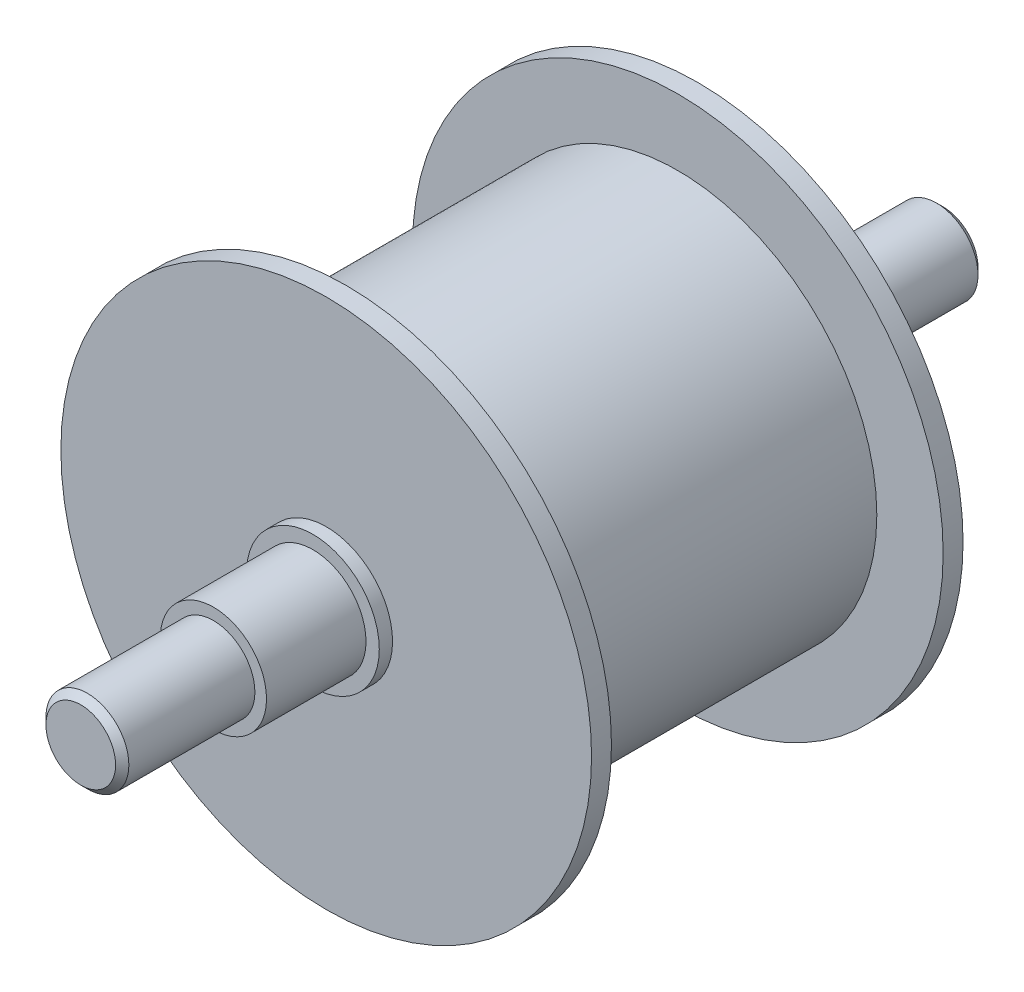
ISO-10303-21;
HEADER;
FILE_DESCRIPTION(('STEP AP214'),'2;1');
FILE_NAME('part.step','',(''),(''),'','','');
FILE_SCHEMA(('AUTOMOTIVE_DESIGN { 1 0 10303 214 1 1 1 1 }'));
ENDSEC;
DATA;
#1=APPLICATION_CONTEXT('core data for automotive mechanical design processes');
#2=APPLICATION_PROTOCOL_DEFINITION('international standard','automotive_design',2000,#1);
#3=PRODUCT_CONTEXT('',#1,'mechanical');
#4=PRODUCT('Part','Part','',(#3));
#5=PRODUCT_RELATED_PRODUCT_CATEGORY('part','',(#4));
#6=PRODUCT_DEFINITION_FORMATION('','',#4);
#7=PRODUCT_DEFINITION_CONTEXT('part definition',#1,'design');
#8=PRODUCT_DEFINITION('design','',#6,#7);
#9=PRODUCT_DEFINITION_SHAPE('','',#8);
#10=(LENGTH_UNIT() NAMED_UNIT(*) SI_UNIT(.MILLI.,.METRE.));
#11=(NAMED_UNIT(*) PLANE_ANGLE_UNIT() SI_UNIT($,.RADIAN.));
#12=(NAMED_UNIT(*) SI_UNIT($,.STERADIAN.) SOLID_ANGLE_UNIT());
#13=UNCERTAINTY_MEASURE_WITH_UNIT(LENGTH_MEASURE(1.E-05),#10,'distance_accuracy_value','');
#14=(GEOMETRIC_REPRESENTATION_CONTEXT(3) GLOBAL_UNCERTAINTY_ASSIGNED_CONTEXT((#13)) GLOBAL_UNIT_ASSIGNED_CONTEXT((#10,
#11,#12)) REPRESENTATION_CONTEXT('',''));
#15=CARTESIAN_POINT('',(0.,0.,0.));
#16=DIRECTION('',(0.,0.,1.));
#17=DIRECTION('',(1.,0.,0.));
#18=AXIS2_PLACEMENT_3D('',#15,#16,#17);
#19=CARTESIAN_POINT('',(0.,0.,40.));
#20=DIRECTION('',(0.,0.,1.));
#21=DIRECTION('',(1.,0.,0.));
#22=AXIS2_PLACEMENT_3D('',#19,#20,#21);
#23=PLANE('',#22);
#24=CARTESIAN_POINT('',(0.,0.,40.));
#25=DIRECTION('',(0.,0.,1.));
#26=DIRECTION('',(1.,0.,0.));
#27=AXIS2_PLACEMENT_3D('',#24,#25,#26);
#28=CIRCLE('',#27,30.);
#29=CARTESIAN_POINT('',(30.,0.,40.));
#30=VERTEX_POINT('',#29);
#31=EDGE_CURVE('E83',#30,#30,#28,.T.);
#32=ORIENTED_EDGE('',*,*,#31,.F.);
#33=EDGE_LOOP('',(#32));
#34=FACE_BOUND('',#33,.T.);
#35=CARTESIAN_POINT('',(0.,0.,40.));
#36=DIRECTION('',(0.,0.,1.));
#37=DIRECTION('',(1.,0.,0.));
#38=AXIS2_PLACEMENT_3D('',#35,#36,#37);
#39=CIRCLE('',#38,40.);
#40=CARTESIAN_POINT('',(40.,0.,40.));
#41=VERTEX_POINT('',#40);
#42=EDGE_CURVE('E87',#41,#41,#39,.T.);
#43=ORIENTED_EDGE('',*,*,#42,.T.);
#44=EDGE_LOOP('',(#43));
#45=FACE_BOUND('',#44,.T.);
#46=ADVANCED_FACE('F42',(#34,#45),#23,.T.);
#47=CARTESIAN_POINT('',(0.,0.,93.));
#48=DIRECTION('',(0.,0.,1.));
#49=DIRECTION('',(1.,0.,0.));
#50=AXIS2_PLACEMENT_3D('',#47,#48,#49);
#51=PLANE('',#50);
#52=CARTESIAN_POINT('',(0.,0.,93.));
#53=DIRECTION('',(0.,0.,1.));
#54=DIRECTION('',(1.,0.,0.));
#55=AXIS2_PLACEMENT_3D('',#52,#53,#54);
#56=CIRCLE('',#55,10.);
#57=CARTESIAN_POINT('',(10.,0.,93.));
#58=VERTEX_POINT('',#57);
#59=EDGE_CURVE('E69',#58,#58,#56,.T.);
#60=ORIENTED_EDGE('',*,*,#59,.F.);
#61=EDGE_LOOP('',(#60));
#62=FACE_BOUND('',#61,.T.);
#63=CARTESIAN_POINT('',(0.,0.,93.));
#64=DIRECTION('',(0.,0.,1.));
#65=DIRECTION('',(1.,0.,0.));
#66=AXIS2_PLACEMENT_3D('',#63,#64,#65);
#67=CIRCLE('',#66,40.);
#68=CARTESIAN_POINT('',(40.,0.,93.));
#69=VERTEX_POINT('',#68);
#70=EDGE_CURVE('E75',#69,#69,#67,.T.);
#71=ORIENTED_EDGE('',*,*,#70,.T.);
#72=EDGE_LOOP('',(#71));
#73=FACE_BOUND('',#72,.T.);
#74=ADVANCED_FACE('F127',(#62,#73),#51,.T.);
#75=CARTESIAN_POINT('',(0.,0.,95.));
#76=DIRECTION('',(0.,0.,1.));
#77=DIRECTION('',(1.,0.,0.));
#78=AXIS2_PLACEMENT_3D('',#75,#76,#77);
#79=PLANE('',#78);
#80=CARTESIAN_POINT('',(0.,0.,95.));
#81=DIRECTION('',(0.,0.,1.));
#82=DIRECTION('',(1.,0.,0.));
#83=AXIS2_PLACEMENT_3D('',#80,#81,#82);
#84=CIRCLE('',#83,8.);
#85=CARTESIAN_POINT('',(8.,0.,95.));
#86=VERTEX_POINT('',#85);
#87=EDGE_CURVE('E65',#86,#86,#84,.T.);
#88=ORIENTED_EDGE('',*,*,#87,.F.);
#89=EDGE_LOOP('',(#88));
#90=FACE_BOUND('',#89,.T.);
#91=CARTESIAN_POINT('',(0.,0.,95.));
#92=DIRECTION('',(0.,0.,1.));
#93=DIRECTION('',(1.,0.,0.));
#94=AXIS2_PLACEMENT_3D('',#91,#92,#93);
#95=CIRCLE('',#94,10.);
#96=CARTESIAN_POINT('',(10.,0.,95.));
#97=VERTEX_POINT('',#96);
#98=EDGE_CURVE('E72',#97,#97,#95,.T.);
#99=ORIENTED_EDGE('',*,*,#98,.T.);
#100=EDGE_LOOP('',(#99));
#101=FACE_BOUND('',#100,.T.);
#102=ADVANCED_FACE('F133',(#90,#101),#79,.T.);
#103=CARTESIAN_POINT('',(0.,0.,110.));
#104=DIRECTION('',(0.,0.,1.));
#105=DIRECTION('',(1.,0.,0.));
#106=AXIS2_PLACEMENT_3D('',#103,#104,#105);
#107=PLANE('',#106);
#108=CARTESIAN_POINT('',(0.,0.,110.));
#109=DIRECTION('',(0.,0.,1.));
#110=DIRECTION('',(1.,0.,0.));
#111=AXIS2_PLACEMENT_3D('',#108,#109,#110);
#112=CIRCLE('',#111,6.25);
#113=CARTESIAN_POINT('',(6.25,0.,110.));
#114=VERTEX_POINT('',#113);
#115=EDGE_CURVE('E62',#114,#114,#112,.T.);
#116=ORIENTED_EDGE('',*,*,#115,.F.);
#117=EDGE_LOOP('',(#116));
#118=FACE_BOUND('',#117,.T.);
#119=CARTESIAN_POINT('',(0.,0.,110.));
#120=DIRECTION('',(0.,0.,1.));
#121=DIRECTION('',(1.,0.,0.));
#122=AXIS2_PLACEMENT_3D('',#119,#120,#121);
#123=CIRCLE('',#122,8.);
#124=CARTESIAN_POINT('',(8.,0.,110.));
#125=VERTEX_POINT('',#124);
#126=EDGE_CURVE('E66',#125,#125,#123,.T.);
#127=ORIENTED_EDGE('',*,*,#126,.T.);
#128=EDGE_LOOP('',(#127));
#129=FACE_BOUND('',#128,.T.);
#130=ADVANCED_FACE('F161',(#118,#129),#107,.T.);
#131=CARTESIAN_POINT('',(0.,0.,110.));
#132=DIRECTION('',(0.,0.,1.));
#133=DIRECTION('',(1.,0.,0.));
#134=AXIS2_PLACEMENT_3D('',#131,#132,#133);
#135=CYLINDRICAL_SURFACE('',#134,6.25);
#136=CARTESIAN_POINT('',(0.,0.,129.));
#137=DIRECTION('',(0.,0.,1.));
#138=DIRECTION('',(1.,0.,0.));
#139=AXIS2_PLACEMENT_3D('',#136,#137,#138);
#140=CIRCLE('',#139,6.25);
#141=CARTESIAN_POINT('',(6.25,0.,129.));
#142=VERTEX_POINT('',#141);
#143=EDGE_CURVE('E53',#142,#142,#140,.F.);
#144=ORIENTED_EDGE('',*,*,#143,.T.);
#145=EDGE_LOOP('',(#144));
#146=FACE_BOUND('',#145,.T.);
#147=ORIENTED_EDGE('',*,*,#115,.T.);
#148=EDGE_LOOP('',(#147));
#149=FACE_BOUND('',#148,.T.);
#150=ADVANCED_FACE('F163',(#146,#149),#135,.T.);
#151=CARTESIAN_POINT('',(0.,0.,130.));
#152=DIRECTION('',(0.,0.,1.));
#153=DIRECTION('',(1.,0.,0.));
#154=AXIS2_PLACEMENT_3D('',#151,#152,#153);
#155=PLANE('',#154);
#156=CARTESIAN_POINT('',(0.,0.,130.));
#157=DIRECTION('',(0.,0.,1.));
#158=DIRECTION('',(1.,0.,0.));
#159=AXIS2_PLACEMENT_3D('',#156,#157,#158);
#160=CIRCLE('',#159,5.25);
#161=CARTESIAN_POINT('',(5.25,0.,130.));
#162=VERTEX_POINT('',#161);
#163=EDGE_CURVE('E57',#162,#162,#160,.T.);
#164=ORIENTED_EDGE('',*,*,#163,.T.);
#165=EDGE_LOOP('',(#164));
#166=FACE_BOUND('',#165,.T.);
#167=ADVANCED_FACE('F157',(#166),#155,.T.);
#168=CARTESIAN_POINT('',(0.,0.,95.));
#169=DIRECTION('',(0.,0.,1.));
#170=DIRECTION('',(1.,0.,0.));
#171=AXIS2_PLACEMENT_3D('',#168,#169,#170);
#172=CYLINDRICAL_SURFACE('',#171,8.);
#173=ORIENTED_EDGE('',*,*,#87,.T.);
#174=EDGE_LOOP('',(#173));
#175=FACE_BOUND('',#174,.T.);
#176=ORIENTED_EDGE('',*,*,#126,.F.);
#177=EDGE_LOOP('',(#176));
#178=FACE_BOUND('',#177,.T.);
#179=ADVANCED_FACE('F152',(#175,#178),#172,.T.);
#180=CARTESIAN_POINT('',(0.,0.,93.));
#181=DIRECTION('',(0.,0.,1.));
#182=DIRECTION('',(1.,0.,0.));
#183=AXIS2_PLACEMENT_3D('',#180,#181,#182);
#184=CYLINDRICAL_SURFACE('',#183,10.);
#185=ORIENTED_EDGE('',*,*,#59,.T.);
#186=EDGE_LOOP('',(#185));
#187=FACE_BOUND('',#186,.T.);
#188=ORIENTED_EDGE('',*,*,#98,.F.);
#189=EDGE_LOOP('',(#188));
#190=FACE_BOUND('',#189,.T.);
#191=ADVANCED_FACE('F149',(#187,#190),#184,.T.);
#192=CARTESIAN_POINT('',(0.,0.,90.));
#193=DIRECTION('',(0.,0.,1.));
#194=DIRECTION('',(1.,0.,0.));
#195=AXIS2_PLACEMENT_3D('',#192,#193,#194);
#196=CYLINDRICAL_SURFACE('',#195,40.);
#197=CARTESIAN_POINT('',(0.,0.,90.));
#198=DIRECTION('',(0.,0.,1.));
#199=DIRECTION('',(1.,0.,0.));
#200=AXIS2_PLACEMENT_3D('',#197,#198,#199);
#201=CIRCLE('',#200,40.);
#202=CARTESIAN_POINT('',(40.,0.,90.));
#203=VERTEX_POINT('',#202);
#204=EDGE_CURVE('E80',#203,#203,#201,.F.);
#205=ORIENTED_EDGE('',*,*,#204,.F.);
#206=EDGE_LOOP('',(#205));
#207=FACE_BOUND('',#206,.T.);
#208=ORIENTED_EDGE('',*,*,#70,.F.);
#209=EDGE_LOOP('',(#208));
#210=FACE_BOUND('',#209,.T.);
#211=ADVANCED_FACE('F145',(#207,#210),#196,.T.);
#212=CARTESIAN_POINT('',(0.,0.,90.));
#213=DIRECTION('',(0.,0.,1.));
#214=DIRECTION('',(1.,0.,0.));
#215=AXIS2_PLACEMENT_3D('',#212,#213,#214);
#216=PLANE('',#215);
#217=ORIENTED_EDGE('',*,*,#204,.T.);
#218=EDGE_LOOP('',(#217));
#219=FACE_BOUND('',#218,.T.);
#220=CARTESIAN_POINT('',(0.,0.,90.));
#221=DIRECTION('',(0.,0.,1.));
#222=DIRECTION('',(1.,0.,0.));
#223=AXIS2_PLACEMENT_3D('',#220,#221,#222);
#224=CIRCLE('',#223,30.);
#225=CARTESIAN_POINT('',(30.,0.,90.));
#226=VERTEX_POINT('',#225);
#227=EDGE_CURVE('E84',#226,#226,#224,.T.);
#228=ORIENTED_EDGE('',*,*,#227,.T.);
#229=EDGE_LOOP('',(#228));
#230=FACE_BOUND('',#229,.T.);
#231=ADVANCED_FACE('F142',(#219,#230),#216,.F.);
#232=CARTESIAN_POINT('',(0.,0.,40.));
#233=DIRECTION('',(0.,0.,1.));
#234=DIRECTION('',(1.,0.,0.));
#235=AXIS2_PLACEMENT_3D('',#232,#233,#234);
#236=CYLINDRICAL_SURFACE('',#235,30.);
#237=ORIENTED_EDGE('',*,*,#31,.T.);
#238=EDGE_LOOP('',(#237));
#239=FACE_BOUND('',#238,.T.);
#240=ORIENTED_EDGE('',*,*,#227,.F.);
#241=EDGE_LOOP('',(#240));
#242=FACE_BOUND('',#241,.T.);
#243=ADVANCED_FACE('F140',(#239,#242),#236,.T.);
#244=CARTESIAN_POINT('',(0.,0.,37.));
#245=DIRECTION('',(0.,0.,1.));
#246=DIRECTION('',(1.,0.,0.));
#247=AXIS2_PLACEMENT_3D('',#244,#245,#246);
#248=CYLINDRICAL_SURFACE('',#247,40.);
#249=CARTESIAN_POINT('',(0.,0.,37.));
#250=DIRECTION('',(0.,0.,1.));
#251=DIRECTION('',(1.,0.,0.));
#252=AXIS2_PLACEMENT_3D('',#249,#250,#251);
#253=CIRCLE('',#252,40.);
#254=CARTESIAN_POINT('',(40.,0.,37.));
#255=VERTEX_POINT('',#254);
#256=EDGE_CURVE('E92',#255,#255,#253,.F.);
#257=ORIENTED_EDGE('',*,*,#256,.F.);
#258=EDGE_LOOP('',(#257));
#259=FACE_BOUND('',#258,.T.);
#260=ORIENTED_EDGE('',*,*,#42,.F.);
#261=EDGE_LOOP('',(#260));
#262=FACE_BOUND('',#261,.T.);
#263=ADVANCED_FACE('F264',(#259,#262),#248,.T.);
#264=CARTESIAN_POINT('',(0.,0.,37.));
#265=DIRECTION('',(0.,0.,1.));
#266=DIRECTION('',(1.,0.,0.));
#267=AXIS2_PLACEMENT_3D('',#264,#265,#266);
#268=PLANE('',#267);
#269=ORIENTED_EDGE('',*,*,#256,.T.);
#270=EDGE_LOOP('',(#269));
#271=FACE_BOUND('',#270,.T.);
#272=CARTESIAN_POINT('',(0.,0.,37.));
#273=DIRECTION('',(0.,0.,1.));
#274=DIRECTION('',(1.,0.,0.));
#275=AXIS2_PLACEMENT_3D('',#272,#273,#274);
#276=CIRCLE('',#275,10.);
#277=CARTESIAN_POINT('',(10.,0.,37.));
#278=VERTEX_POINT('',#277);
#279=EDGE_CURVE('E95',#278,#278,#276,.T.);
#280=ORIENTED_EDGE('',*,*,#279,.T.);
#281=EDGE_LOOP('',(#280));
#282=FACE_BOUND('',#281,.T.);
#283=ADVANCED_FACE('F254',(#271,#282),#268,.F.);
#284=CARTESIAN_POINT('',(0.,0.,35.));
#285=DIRECTION('',(0.,0.,1.));
#286=DIRECTION('',(1.,0.,0.));
#287=AXIS2_PLACEMENT_3D('',#284,#285,#286);
#288=CYLINDRICAL_SURFACE('',#287,10.);
#289=CARTESIAN_POINT('',(0.,0.,35.));
#290=DIRECTION('',(0.,0.,1.));
#291=DIRECTION('',(1.,0.,0.));
#292=AXIS2_PLACEMENT_3D('',#289,#290,#291);
#293=CIRCLE('',#292,10.);
#294=CARTESIAN_POINT('',(10.,0.,35.));
#295=VERTEX_POINT('',#294);
#296=EDGE_CURVE('E98',#295,#295,#293,.F.);
#297=ORIENTED_EDGE('',*,*,#296,.F.);
#298=EDGE_LOOP('',(#297));
#299=FACE_BOUND('',#298,.T.);
#300=ORIENTED_EDGE('',*,*,#279,.F.);
#301=EDGE_LOOP('',(#300));
#302=FACE_BOUND('',#301,.T.);
#303=ADVANCED_FACE('F244',(#299,#302),#288,.T.);
#304=CARTESIAN_POINT('',(0.,0.,35.));
#305=DIRECTION('',(0.,0.,1.));
#306=DIRECTION('',(1.,0.,0.));
#307=AXIS2_PLACEMENT_3D('',#304,#305,#306);
#308=PLANE('',#307);
#309=ORIENTED_EDGE('',*,*,#296,.T.);
#310=EDGE_LOOP('',(#309));
#311=FACE_BOUND('',#310,.T.);
#312=CARTESIAN_POINT('',(0.,0.,35.));
#313=DIRECTION('',(0.,0.,1.));
#314=DIRECTION('',(1.,0.,0.));
#315=AXIS2_PLACEMENT_3D('',#312,#313,#314);
#316=CIRCLE('',#315,8.);
#317=CARTESIAN_POINT('',(8.,0.,35.));
#318=VERTEX_POINT('',#317);
#319=EDGE_CURVE('E101',#318,#318,#316,.T.);
#320=ORIENTED_EDGE('',*,*,#319,.T.);
#321=EDGE_LOOP('',(#320));
#322=FACE_BOUND('',#321,.T.);
#323=ADVANCED_FACE('F234',(#311,#322),#308,.F.);
#324=CARTESIAN_POINT('',(0.,0.,20.));
#325=DIRECTION('',(0.,0.,1.));
#326=DIRECTION('',(1.,0.,0.));
#327=AXIS2_PLACEMENT_3D('',#324,#325,#326);
#328=CYLINDRICAL_SURFACE('',#327,8.);
#329=CARTESIAN_POINT('',(0.,0.,20.));
#330=DIRECTION('',(0.,0.,1.));
#331=DIRECTION('',(1.,0.,0.));
#332=AXIS2_PLACEMENT_3D('',#329,#330,#331);
#333=CIRCLE('',#332,8.);
#334=CARTESIAN_POINT('',(8.,0.,20.));
#335=VERTEX_POINT('',#334);
#336=EDGE_CURVE('E104',#335,#335,#333,.F.);
#337=ORIENTED_EDGE('',*,*,#336,.F.);
#338=EDGE_LOOP('',(#337));
#339=FACE_BOUND('',#338,.T.);
#340=ORIENTED_EDGE('',*,*,#319,.F.);
#341=EDGE_LOOP('',(#340));
#342=FACE_BOUND('',#341,.T.);
#343=ADVANCED_FACE('F123',(#339,#342),#328,.T.);
#344=CARTESIAN_POINT('',(0.,0.,20.));
#345=DIRECTION('',(0.,0.,1.));
#346=DIRECTION('',(1.,0.,0.));
#347=AXIS2_PLACEMENT_3D('',#344,#345,#346);
#348=PLANE('',#347);
#349=ORIENTED_EDGE('',*,*,#336,.T.);
#350=EDGE_LOOP('',(#349));
#351=FACE_BOUND('',#350,.T.);
#352=CARTESIAN_POINT('',(0.,0.,20.));
#353=DIRECTION('',(0.,0.,1.));
#354=DIRECTION('',(1.,0.,0.));
#355=AXIS2_PLACEMENT_3D('',#352,#353,#354);
#356=CIRCLE('',#355,6.25);
#357=CARTESIAN_POINT('',(6.25,0.,20.));
#358=VERTEX_POINT('',#357);
#359=EDGE_CURVE('E107',#358,#358,#356,.T.);
#360=ORIENTED_EDGE('',*,*,#359,.T.);
#361=EDGE_LOOP('',(#360));
#362=FACE_BOUND('',#361,.T.);
#363=ADVANCED_FACE('F111',(#351,#362),#348,.F.);
#364=CARTESIAN_POINT('',(0.,0.,0.));
#365=DIRECTION('',(0.,0.,1.));
#366=DIRECTION('',(1.,0.,0.));
#367=AXIS2_PLACEMENT_3D('',#364,#365,#366);
#368=CYLINDRICAL_SURFACE('',#367,6.25);
#369=CARTESIAN_POINT('',(0.,0.,1.));
#370=DIRECTION('',(0.,0.,1.));
#371=DIRECTION('',(1.,0.,0.));
#372=AXIS2_PLACEMENT_3D('',#369,#370,#371);
#373=CIRCLE('',#372,6.25);
#374=CARTESIAN_POINT('',(6.25,0.,1.));
#375=VERTEX_POINT('',#374);
#376=EDGE_CURVE('E49',#375,#375,#373,.T.);
#377=ORIENTED_EDGE('',*,*,#376,.T.);
#378=EDGE_LOOP('',(#377));
#379=FACE_BOUND('',#378,.T.);
#380=ORIENTED_EDGE('',*,*,#359,.F.);
#381=EDGE_LOOP('',(#380));
#382=FACE_BOUND('',#381,.T.);
#383=ADVANCED_FACE('F113',(#379,#382),#368,.T.);
#384=CARTESIAN_POINT('',(0.,0.,0.));
#385=DIRECTION('',(0.,0.,1.));
#386=DIRECTION('',(1.,0.,0.));
#387=AXIS2_PLACEMENT_3D('',#384,#385,#386);
#388=PLANE('',#387);
#389=CARTESIAN_POINT('',(0.,0.,0.));
#390=DIRECTION('',(0.,0.,1.));
#391=DIRECTION('',(1.,0.,0.));
#392=AXIS2_PLACEMENT_3D('',#389,#390,#391);
#393=CIRCLE('',#392,5.25);
#394=CARTESIAN_POINT('',(5.25,0.,0.));
#395=VERTEX_POINT('',#394);
#396=EDGE_CURVE('E11',#395,#395,#393,.F.);
#397=ORIENTED_EDGE('',*,*,#396,.T.);
#398=EDGE_LOOP('',(#397));
#399=FACE_BOUND('',#398,.T.);
#400=ADVANCED_FACE('F115',(#399),#388,.F.);
#401=CARTESIAN_POINT('',(0.,0.,130.));
#402=DIRECTION('',(0.,0.,-1.));
#403=DIRECTION('',(-1.,0.,0.));
#404=AXIS2_PLACEMENT_3D('',#401,#402,#403);
#405=CONICAL_SURFACE('',#404,5.25,0.785398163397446);
#406=ORIENTED_EDGE('',*,*,#143,.F.);
#407=EDGE_LOOP('',(#406));
#408=FACE_BOUND('',#407,.T.);
#409=ORIENTED_EDGE('',*,*,#163,.F.);
#410=EDGE_LOOP('',(#409));
#411=FACE_BOUND('',#410,.T.);
#412=ADVANCED_FACE('F121',(#408,#411),#405,.T.);
#413=CARTESIAN_POINT('',(0.,0.,1.));
#414=DIRECTION('',(0.,0.,1.));
#415=DIRECTION('',(1.,0.,0.));
#416=AXIS2_PLACEMENT_3D('',#413,#414,#415);
#417=CONICAL_SURFACE('',#416,6.25,0.785398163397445);
#418=ORIENTED_EDGE('',*,*,#396,.F.);
#419=EDGE_LOOP('',(#418));
#420=FACE_BOUND('',#419,.T.);
#421=ORIENTED_EDGE('',*,*,#376,.F.);
#422=EDGE_LOOP('',(#421));
#423=FACE_BOUND('',#422,.T.);
#424=ADVANCED_FACE('F44',(#420,#423),#417,.T.);
#425=CLOSED_SHELL('',(#46,#74,#102,#130,#150,#167,#179,#191,#211,#231,#243,#263,#283,#303,#323,
#343,#363,#383,#400,#412,#424));
#426=MANIFOLD_SOLID_BREP('B2',#425);
#427=ADVANCED_BREP_SHAPE_REPRESENTATION('',(#18,#426),#14);
#428=SHAPE_DEFINITION_REPRESENTATION(#9,#427);
ENDSEC;
END-ISO-10303-21;
